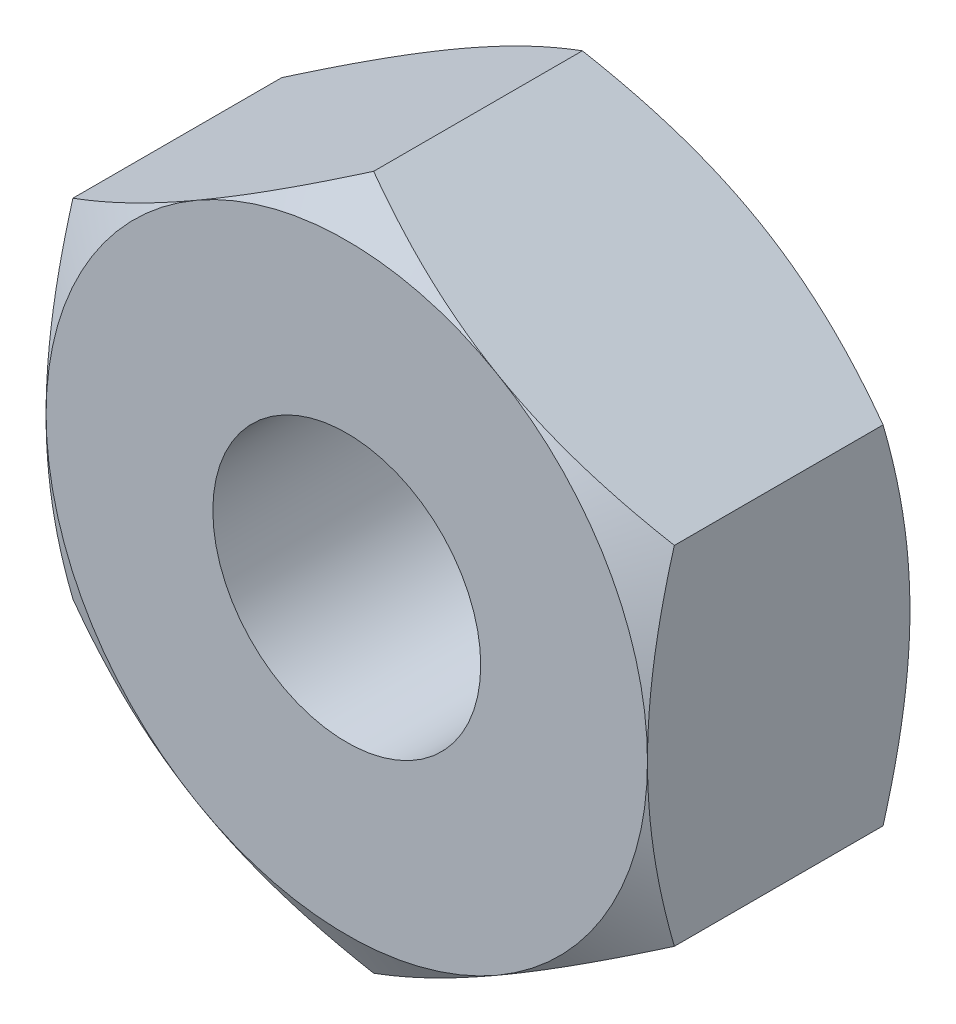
ISO-10303-21;
HEADER;
FILE_DESCRIPTION(('STEP AP214'),'2;1');
FILE_NAME('part.step','',(''),(''),'','','');
FILE_SCHEMA(('AUTOMOTIVE_DESIGN { 1 0 10303 214 1 1 1 1 }'));
ENDSEC;
DATA;
#1=APPLICATION_CONTEXT('core data for automotive mechanical design processes');
#2=APPLICATION_PROTOCOL_DEFINITION('international standard','automotive_design',2000,#1);
#3=PRODUCT_CONTEXT('',#1,'mechanical');
#4=PRODUCT('Part','Part','',(#3));
#5=PRODUCT_RELATED_PRODUCT_CATEGORY('part','',(#4));
#6=PRODUCT_DEFINITION_FORMATION('','',#4);
#7=PRODUCT_DEFINITION_CONTEXT('part definition',#1,'design');
#8=PRODUCT_DEFINITION('design','',#6,#7);
#9=PRODUCT_DEFINITION_SHAPE('','',#8);
#10=(LENGTH_UNIT() NAMED_UNIT(*) SI_UNIT(.MILLI.,.METRE.));
#11=(NAMED_UNIT(*) PLANE_ANGLE_UNIT() SI_UNIT($,.RADIAN.));
#12=(NAMED_UNIT(*) SI_UNIT($,.STERADIAN.) SOLID_ANGLE_UNIT());
#13=UNCERTAINTY_MEASURE_WITH_UNIT(LENGTH_MEASURE(1.E-05),#10,'distance_accuracy_value','');
#14=(GEOMETRIC_REPRESENTATION_CONTEXT(3) GLOBAL_UNCERTAINTY_ASSIGNED_CONTEXT((#13)) GLOBAL_UNIT_ASSIGNED_CONTEXT((#10,
#11,#12)) REPRESENTATION_CONTEXT('',''));
#15=CARTESIAN_POINT('',(0.,0.,0.));
#16=DIRECTION('',(0.,0.,1.));
#17=DIRECTION('',(1.,0.,0.));
#18=AXIS2_PLACEMENT_3D('',#15,#16,#17);
#19=CARTESIAN_POINT('',(-2.75,4.76313972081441,0.));
#20=DIRECTION('',(0.,0.,-1.));
#21=DIRECTION('',(-1.,0.,0.));
#22=AXIS2_PLACEMENT_3D('',#19,#20,#21);
#23=PLANE('',#22);
#24=CARTESIAN_POINT('',(0.,0.,0.));
#25=DIRECTION('',(0.,0.,1.));
#26=DIRECTION('',(1.,0.,0.));
#27=AXIS2_PLACEMENT_3D('',#24,#25,#26);
#28=CIRCLE('',#27,1.225);
#29=CARTESIAN_POINT('',(1.225,0.,0.));
#30=VERTEX_POINT('',#29);
#31=EDGE_CURVE('E315',#30,#30,#28,.T.);
#32=ORIENTED_EDGE('',*,*,#31,.F.);
#33=EDGE_LOOP('',(#32));
#34=FACE_BOUND('',#33,.T.);
#35=CARTESIAN_POINT('',(0.,0.,0.));
#36=DIRECTION('',(0.,0.,-1.));
#37=DIRECTION('',(-1.,0.,0.));
#38=AXIS2_PLACEMENT_3D('',#35,#36,#37);
#39=CIRCLE('',#38,2.75);
#40=CARTESIAN_POINT('',(-2.75,0.,0.));
#41=VERTEX_POINT('',#40);
#42=CARTESIAN_POINT('',(-1.375,2.38156986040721,0.));
#43=VERTEX_POINT('',#42);
#44=EDGE_CURVE('E323',#41,#43,#39,.T.);
#45=ORIENTED_EDGE('',*,*,#44,.F.);
#46=CARTESIAN_POINT('',(0.,0.,0.));
#47=DIRECTION('',(0.,0.,-1.));
#48=DIRECTION('',(-1.,0.,0.));
#49=AXIS2_PLACEMENT_3D('',#46,#47,#48);
#50=CIRCLE('',#49,2.75);
#51=CARTESIAN_POINT('',(-1.375,-2.38156986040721,0.));
#52=VERTEX_POINT('',#51);
#53=EDGE_CURVE('E143',#41,#52,#50,.F.);
#54=ORIENTED_EDGE('',*,*,#53,.T.);
#55=CARTESIAN_POINT('',(1.375,-2.38156986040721,0.));
#56=VERTEX_POINT('',#55);
#57=EDGE_CURVE('E245',#52,#56,#50,.F.);
#58=ORIENTED_EDGE('',*,*,#57,.T.);
#59=CARTESIAN_POINT('',(2.75,0.,0.));
#60=VERTEX_POINT('',#59);
#61=EDGE_CURVE('E146',#56,#60,#50,.F.);
#62=ORIENTED_EDGE('',*,*,#61,.T.);
#63=CARTESIAN_POINT('',(1.375,2.38156986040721,0.));
#64=VERTEX_POINT('',#63);
#65=EDGE_CURVE('E121',#60,#64,#50,.F.);
#66=ORIENTED_EDGE('',*,*,#65,.T.);
#67=EDGE_CURVE('E134',#64,#43,#50,.F.);
#68=ORIENTED_EDGE('',*,*,#67,.T.);
#69=EDGE_LOOP('',(#45,#54,#58,#62,#66,#68));
#70=FACE_BOUND('',#69,.T.);
#71=ADVANCED_FACE('F26',(#34,#70),#23,.F.);
#72=CARTESIAN_POINT('',(0.,0.,0.));
#73=DIRECTION('',(0.,0.,-1.));
#74=DIRECTION('',(-1.,0.,0.));
#75=AXIS2_PLACEMENT_3D('',#72,#73,#74);
#76=CONICAL_SURFACE('',#75,2.75,1.0471975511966);
#77=CARTESIAN_POINT('',(-2.75,-4.34466851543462,-1.38093653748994));
#78=CARTESIAN_POINT('',(-2.75,-4.22386779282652,-1.32202064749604));
#79=CARTESIAN_POINT('',(-2.75,-4.10279820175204,-1.26364700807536));
#80=CARTESIAN_POINT('',(-2.75,-3.85997859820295,-1.14828767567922));
#81=CARTESIAN_POINT('',(-2.75,-3.73822848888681,-1.09130218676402));
#82=CARTESIAN_POINT('',(-2.75,-3.49331526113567,-0.978752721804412));
#83=CARTESIAN_POINT('',(-2.75,-3.37014810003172,-0.923197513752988));
#84=CARTESIAN_POINT('',(-2.75,-3.1228617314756,-0.814256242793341));
#85=CARTESIAN_POINT('',(-2.75,-2.99874256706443,-0.760870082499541));
#86=CARTESIAN_POINT('',(-2.75,-2.74504756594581,-0.655040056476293));
#87=CARTESIAN_POINT('',(-2.75,-2.61543135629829,-0.602692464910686));
#88=CARTESIAN_POINT('',(-2.75,-2.35471222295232,-0.501769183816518));
#89=CARTESIAN_POINT('',(-2.75,-2.22360913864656,-0.453193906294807));
#90=CARTESIAN_POINT('',(-2.75,-1.95992838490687,-0.36103232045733));
#91=CARTESIAN_POINT('',(-2.75,-1.82735405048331,-0.317436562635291));
#92=CARTESIAN_POINT('',(-2.75,-1.56030503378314,-0.236579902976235));
#93=CARTESIAN_POINT('',(-2.75,-1.42583093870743,-0.199317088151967));
#94=CARTESIAN_POINT('',(-2.75,-1.1556720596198,-0.133064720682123));
#95=CARTESIAN_POINT('',(-2.75,-1.01999923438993,-0.104027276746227));
#96=CARTESIAN_POINT('',(-2.75,-0.746885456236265,-0.0558064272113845));
#97=CARTESIAN_POINT('',(-2.75,-0.609444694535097,-0.036621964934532));
#98=CARTESIAN_POINT('',(-2.75,-0.335308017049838,-0.00988438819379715));
#99=CARTESIAN_POINT('',(-2.75,-0.198627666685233,-0.00217562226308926));
#100=CARTESIAN_POINT('',(-2.75,0.0749013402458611,0.00137225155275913));
#101=CARTESIAN_POINT('',(-2.75,0.211749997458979,-0.00278868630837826));
#102=CARTESIAN_POINT('',(-2.75,0.441773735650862,-0.0194575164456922));
#103=CARTESIAN_POINT('',(-2.75,0.535183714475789,-0.0289378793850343));
#104=CARTESIAN_POINT('',(-2.75,0.721369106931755,-0.0528801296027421));
#105=CARTESIAN_POINT('',(-2.75,0.814144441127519,-0.067342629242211));
#106=CARTESIAN_POINT('',(-2.75,1.09135512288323,-0.117450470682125));
#107=CARTESIAN_POINT('',(-2.75,1.27458276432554,-0.1598085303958));
#108=CARTESIAN_POINT('',(-2.75,1.64148663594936,-0.258901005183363));
#109=CARTESIAN_POINT('',(-2.75,1.82507634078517,-0.315943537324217));
#110=CARTESIAN_POINT('',(-2.75,2.09789706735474,-0.408810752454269));
#111=CARTESIAN_POINT('',(-2.75,2.18840332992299,-0.440981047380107));
#112=CARTESIAN_POINT('',(-2.75,2.36865794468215,-0.507377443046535));
#113=CARTESIAN_POINT('',(-2.75,2.45840631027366,-0.541603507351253));
#114=CARTESIAN_POINT('',(-2.75,2.68603060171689,-0.630917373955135));
#115=CARTESIAN_POINT('',(-2.75,2.82343831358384,-0.687195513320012));
#116=CARTESIAN_POINT('',(-2.75,3.09693392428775,-0.802882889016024));
#117=CARTESIAN_POINT('',(-2.75,3.23302170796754,-0.862292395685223));
#118=CARTESIAN_POINT('',(-2.75,3.50414954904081,-0.983551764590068));
#119=CARTESIAN_POINT('',(-2.75,3.63918929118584,-1.04540232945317));
#120=CARTESIAN_POINT('',(-2.75,3.90838030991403,-1.17101091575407));
#121=CARTESIAN_POINT('',(-2.75,4.0425315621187,-1.23476898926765));
#122=CARTESIAN_POINT('',(-2.75,4.44426655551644,-1.42847314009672));
#123=CARTESIAN_POINT('',(-2.75,4.71075917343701,-1.56067980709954));
#124=CARTESIAN_POINT('',(-2.75,5.2417025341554,-1.82899066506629));
#125=CARTESIAN_POINT('',(-2.75,5.50615362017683,-1.96509418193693));
#126=CARTESIAN_POINT('',(-2.75,6.00831212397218,-2.22681256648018));
#127=CARTESIAN_POINT('',(-2.75,6.24614899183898,-2.35217951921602));
#128=CARTESIAN_POINT('',(-2.75,6.72096497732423,-2.60455330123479));
#129=CARTESIAN_POINT('',(-2.75,6.95794405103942,-2.73156021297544));
#130=CARTESIAN_POINT('',(-2.75,7.43050912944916,-2.986411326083));
#131=CARTESIAN_POINT('',(-2.75,7.66609717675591,-3.11425174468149));
#132=CARTESIAN_POINT('',(-2.75,8.13673290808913,-3.37088488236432));
#133=CARTESIAN_POINT('',(-2.75,8.37178062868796,-3.4996775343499));
#134=CARTESIAN_POINT('',(-2.75,8.60663455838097,-3.62882004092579));
#135=B_SPLINE_CURVE_WITH_KNOTS('',3,(#77,#78,#79,#80,#81,#82,#83,#84,#85,#86,#87,#88,#89,#90,
#91,#92,#93,#94,#95,#96,#97,#98,#99,#100,#101,#102,#103,#104,#105,#106,#107,#108,#109,#110,#111,
#112,#113,#114,#115,#116,#117,#118,#119,#120,#121,#122,#123,#124,#125,#126,#127,#128,#129,#130,
#131,#132,#133,#134),.UNSPECIFIED.,.F.,.F.,(4,2,2,2,2,2,2,2,2,2,2,2,2,2,2,2,2,2,2,2,2,2,2,2,2,2,
2,2,4),(0.,0.403210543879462,0.806480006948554,1.21181340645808,1.61712858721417,
2.03644659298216,2.45581033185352,2.87436454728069,3.29279210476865,3.70873084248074,
4.12462496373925,4.53482497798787,4.94502657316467,5.22656209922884,5.5081322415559,
6.07154931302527,6.64791900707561,6.93606074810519,7.22419738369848,7.66960136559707,
8.11504386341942,8.56061552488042,9.00619936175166,9.89859387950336,10.7908349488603,
11.5973926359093,12.4039910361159,13.2081055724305,14.0121639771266),.UNSPECIFIED.);
#136=CARTESIAN_POINT('',(-2.75,1.58771324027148,-0.245620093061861));
#137=VERTEX_POINT('',#136);
#138=EDGE_CURVE('E151',#137,#41,#135,.F.);
#139=ORIENTED_EDGE('',*,*,#138,.T.);
#140=ORIENTED_EDGE('',*,*,#44,.T.);
#141=CARTESIAN_POINT('',(0.0002,3.17554195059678,-0.245686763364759));
#142=CARTESIAN_POINT('',(-0.120649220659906,3.10576962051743,-0.205387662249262));
#143=CARTESIAN_POINT('',(-0.242541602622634,3.03539502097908,-0.168736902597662));
#144=CARTESIAN_POINT('',(-0.488437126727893,2.89342717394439,-0.104762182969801));
#145=CARTESIAN_POINT('',(-0.612444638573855,2.82183140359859,-0.077460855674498));
#146=CARTESIAN_POINT('',(-0.858922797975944,2.67952717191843,-0.0349617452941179));
#147=CARTESIAN_POINT('',(-0.981355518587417,2.60884060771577,-0.019481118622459));
#148=CARTESIAN_POINT('',(-1.22679714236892,2.46713482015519,-0.000999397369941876));
#149=CARTESIAN_POINT('',(-1.34980515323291,2.39611611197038,0.00201700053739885));
#150=CARTESIAN_POINT('',(-1.57965878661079,2.26341005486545,-0.0042531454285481));
#151=CARTESIAN_POINT('',(-1.68653879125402,2.20170285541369,-0.0120001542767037));
#152=CARTESIAN_POINT('',(-1.89960246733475,2.07869048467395,-0.0365551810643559));
#153=CARTESIAN_POINT('',(-2.00578540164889,2.01738573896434,-0.0533715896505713));
#154=CARTESIAN_POINT('',(-2.21928848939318,1.89411967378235,-0.0954119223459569));
#155=CARTESIAN_POINT('',(-2.32658161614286,1.83217395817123,-0.120814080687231));
#156=CARTESIAN_POINT('',(-2.53956747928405,1.70920651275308,-0.178467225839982));
#157=CARTESIAN_POINT('',(-2.64526294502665,1.64818320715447,-0.210704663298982));
#158=CARTESIAN_POINT('',(-2.7502,1.58759777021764,-0.245686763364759));
#159=B_SPLINE_CURVE_WITH_KNOTS('',3,(#141,#142,#143,#144,#145,#146,#147,#148,#149,#150,#151,
#152,#153,#154,#155,#156,#157,#158),.UNSPECIFIED.,.F.,.F.,(4,2,2,2,2,2,2,2,4),(0.,
0.435912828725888,0.872873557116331,1.29901931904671,1.72464171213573,2.09526089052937,
2.46622354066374,2.84541551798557,3.22386274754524),.UNSPECIFIED.);
#160=EDGE_CURVE('E183',#43,#137,#159,.T.);
#161=ORIENTED_EDGE('',*,*,#160,.T.);
#162=EDGE_LOOP('',(#139,#140,#161));
#163=FACE_BOUND('',#162,.T.);
#164=ADVANCED_FACE('F170',(#163),#76,.T.);
#165=CARTESIAN_POINT('',(2.7502,1.58759777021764,-0.245686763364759));
#166=CARTESIAN_POINT('',(2.62935077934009,1.65737010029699,-0.205387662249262));
#167=CARTESIAN_POINT('',(2.50745839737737,1.72774469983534,-0.168736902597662));
#168=CARTESIAN_POINT('',(2.26156287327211,1.86971254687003,-0.104762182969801));
#169=CARTESIAN_POINT('',(2.13755536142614,1.94130831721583,-0.0774608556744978));
#170=CARTESIAN_POINT('',(1.89107720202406,2.08361254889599,-0.0349617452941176));
#171=CARTESIAN_POINT('',(1.76864448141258,2.15429911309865,-0.0194811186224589));
#172=CARTESIAN_POINT('',(1.52320285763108,2.29600490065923,-0.000999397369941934));
#173=CARTESIAN_POINT('',(1.40019484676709,2.36702360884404,0.00201700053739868));
#174=CARTESIAN_POINT('',(1.17034121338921,2.49972966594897,-0.00425314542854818));
#175=CARTESIAN_POINT('',(1.06346120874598,2.56143686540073,-0.0120001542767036));
#176=CARTESIAN_POINT('',(0.85039753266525,2.68444923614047,-0.0365551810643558));
#177=CARTESIAN_POINT('',(0.744214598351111,2.74575398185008,-0.0533715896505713));
#178=CARTESIAN_POINT('',(0.530711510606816,2.86902004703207,-0.0954119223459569));
#179=CARTESIAN_POINT('',(0.423418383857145,2.93096576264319,-0.120814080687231));
#180=CARTESIAN_POINT('',(0.210432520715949,3.05393320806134,-0.178467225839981));
#181=CARTESIAN_POINT('',(0.104737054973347,3.11495651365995,-0.210704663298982));
#182=CARTESIAN_POINT('',(-0.000199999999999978,3.17554195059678,-0.245686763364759));
#183=B_SPLINE_CURVE_WITH_KNOTS('',3,(#165,#166,#167,#168,#169,#170,#171,#172,#173,#174,#175,
#176,#177,#178,#179,#180,#181,#182),.UNSPECIFIED.,.F.,.F.,(4,2,2,2,2,2,2,2,4),(0.,
0.435912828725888,0.872873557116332,1.29901931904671,1.72464171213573,2.09526089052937,
2.46622354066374,2.84541551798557,3.22386274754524),.UNSPECIFIED.);
#184=CARTESIAN_POINT('',(0.,3.17542648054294,-0.245620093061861));
#185=VERTEX_POINT('',#184);
#186=EDGE_CURVE('E130',#64,#185,#183,.T.);
#187=ORIENTED_EDGE('',*,*,#186,.T.);
#188=EDGE_CURVE('E137',#185,#43,#159,.T.);
#189=ORIENTED_EDGE('',*,*,#188,.T.);
#190=ORIENTED_EDGE('',*,*,#67,.F.);
#191=EDGE_LOOP('',(#187,#189,#190));
#192=FACE_BOUND('',#191,.T.);
#193=ADVANCED_FACE('F135',(#192),#76,.T.);
#194=CARTESIAN_POINT('',(2.75,-4.34466851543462,-1.38093653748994));
#195=CARTESIAN_POINT('',(2.75,-4.22386779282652,-1.32202064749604));
#196=CARTESIAN_POINT('',(2.75,-4.10279820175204,-1.26364700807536));
#197=CARTESIAN_POINT('',(2.75,-3.85997859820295,-1.14828767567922));
#198=CARTESIAN_POINT('',(2.75,-3.73822848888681,-1.09130218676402));
#199=CARTESIAN_POINT('',(2.75,-3.49331526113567,-0.978752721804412));
#200=CARTESIAN_POINT('',(2.75,-3.37014810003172,-0.923197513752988));
#201=CARTESIAN_POINT('',(2.75,-3.1228617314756,-0.814256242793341));
#202=CARTESIAN_POINT('',(2.75,-2.99874256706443,-0.760870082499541));
#203=CARTESIAN_POINT('',(2.75,-2.74504756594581,-0.655040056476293));
#204=CARTESIAN_POINT('',(2.75,-2.61543135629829,-0.602692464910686));
#205=CARTESIAN_POINT('',(2.75,-2.35471222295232,-0.501769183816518));
#206=CARTESIAN_POINT('',(2.75,-2.22360913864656,-0.453193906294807));
#207=CARTESIAN_POINT('',(2.75,-1.95992838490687,-0.36103232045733));
#208=CARTESIAN_POINT('',(2.75,-1.82735405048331,-0.317436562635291));
#209=CARTESIAN_POINT('',(2.75,-1.56030503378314,-0.236579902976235));
#210=CARTESIAN_POINT('',(2.75,-1.42583093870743,-0.199317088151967));
#211=CARTESIAN_POINT('',(2.75,-1.1556720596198,-0.133064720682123));
#212=CARTESIAN_POINT('',(2.75,-1.01999923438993,-0.104027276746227));
#213=CARTESIAN_POINT('',(2.75,-0.746885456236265,-0.0558064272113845));
#214=CARTESIAN_POINT('',(2.75,-0.609444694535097,-0.036621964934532));
#215=CARTESIAN_POINT('',(2.75,-0.335308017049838,-0.00988438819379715));
#216=CARTESIAN_POINT('',(2.75,-0.198627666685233,-0.00217562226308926));
#217=CARTESIAN_POINT('',(2.75,0.0749013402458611,0.00137225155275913));
#218=CARTESIAN_POINT('',(2.75,0.211749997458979,-0.00278868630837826));
#219=CARTESIAN_POINT('',(2.75,0.441773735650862,-0.0194575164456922));
#220=CARTESIAN_POINT('',(2.75,0.535183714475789,-0.0289378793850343));
#221=CARTESIAN_POINT('',(2.75,0.721369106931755,-0.0528801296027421));
#222=CARTESIAN_POINT('',(2.75,0.814144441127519,-0.067342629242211));
#223=CARTESIAN_POINT('',(2.75,1.09135512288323,-0.117450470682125));
#224=CARTESIAN_POINT('',(2.75,1.27458276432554,-0.1598085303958));
#225=CARTESIAN_POINT('',(2.75,1.64148663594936,-0.258901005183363));
#226=CARTESIAN_POINT('',(2.75,1.82507634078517,-0.315943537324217));
#227=CARTESIAN_POINT('',(2.75,2.09789706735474,-0.408810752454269));
#228=CARTESIAN_POINT('',(2.75,2.18840332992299,-0.440981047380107));
#229=CARTESIAN_POINT('',(2.75,2.36865794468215,-0.507377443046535));
#230=CARTESIAN_POINT('',(2.75,2.45840631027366,-0.541603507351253));
#231=CARTESIAN_POINT('',(2.75,2.68603060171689,-0.630917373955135));
#232=CARTESIAN_POINT('',(2.75,2.82343831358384,-0.687195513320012));
#233=CARTESIAN_POINT('',(2.75,3.09693392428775,-0.802882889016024));
#234=CARTESIAN_POINT('',(2.75,3.23302170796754,-0.862292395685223));
#235=CARTESIAN_POINT('',(2.75,3.50414954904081,-0.983551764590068));
#236=CARTESIAN_POINT('',(2.75,3.63918929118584,-1.04540232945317));
#237=CARTESIAN_POINT('',(2.75,3.90838030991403,-1.17101091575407));
#238=CARTESIAN_POINT('',(2.75,4.0425315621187,-1.23476898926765));
#239=CARTESIAN_POINT('',(2.75,4.44426655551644,-1.42847314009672));
#240=CARTESIAN_POINT('',(2.75,4.71075917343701,-1.56067980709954));
#241=CARTESIAN_POINT('',(2.75,5.2417025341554,-1.82899066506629));
#242=CARTESIAN_POINT('',(2.75,5.50615362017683,-1.96509418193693));
#243=CARTESIAN_POINT('',(2.75,6.00831212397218,-2.22681256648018));
#244=CARTESIAN_POINT('',(2.75,6.24614899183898,-2.35217951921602));
#245=CARTESIAN_POINT('',(2.75,6.72096497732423,-2.60455330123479));
#246=CARTESIAN_POINT('',(2.75,6.95794405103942,-2.73156021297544));
#247=CARTESIAN_POINT('',(2.75,7.43050912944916,-2.986411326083));
#248=CARTESIAN_POINT('',(2.75,7.66609717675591,-3.11425174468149));
#249=CARTESIAN_POINT('',(2.75,8.13673290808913,-3.37088488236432));
#250=CARTESIAN_POINT('',(2.75,8.37178062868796,-3.4996775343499));
#251=CARTESIAN_POINT('',(2.75,8.60663455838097,-3.62882004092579));
#252=B_SPLINE_CURVE_WITH_KNOTS('',3,(#194,#195,#196,#197,#198,#199,#200,#201,#202,#203,#204,
#205,#206,#207,#208,#209,#210,#211,#212,#213,#214,#215,#216,#217,#218,#219,#220,#221,#222,#223,
#224,#225,#226,#227,#228,#229,#230,#231,#232,#233,#234,#235,#236,#237,#238,#239,#240,#241,#242,
#243,#244,#245,#246,#247,#248,#249,#250,#251),.UNSPECIFIED.,.F.,.F.,(4,2,2,2,2,2,2,2,2,2,2,2,2,
2,2,2,2,2,2,2,2,2,2,2,2,2,2,2,4),(0.,0.403210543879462,0.806480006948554,1.21181340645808,
1.61712858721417,2.03644659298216,2.45581033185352,2.87436454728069,3.29279210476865,
3.70873084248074,4.12462496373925,4.53482497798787,4.94502657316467,5.22656209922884,
5.5081322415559,6.07154931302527,6.64791900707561,6.93606074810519,7.22419738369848,
7.66960136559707,8.11504386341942,8.56061552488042,9.00619936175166,9.89859387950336,
10.7908349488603,11.5973926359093,12.4039910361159,13.2081055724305,14.0121639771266),.UNSPECIFIED.);
#253=CARTESIAN_POINT('',(2.75,1.58771324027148,-0.245620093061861));
#254=VERTEX_POINT('',#253);
#255=EDGE_CURVE('E124',#60,#254,#252,.T.);
#256=ORIENTED_EDGE('',*,*,#255,.T.);
#257=EDGE_CURVE('E117',#254,#64,#183,.T.);
#258=ORIENTED_EDGE('',*,*,#257,.T.);
#259=ORIENTED_EDGE('',*,*,#65,.F.);
#260=EDGE_LOOP('',(#256,#258,#259));
#261=FACE_BOUND('',#260,.T.);
#262=ADVANCED_FACE('F119',(#261),#76,.T.);
#263=CARTESIAN_POINT('',(-0.0002,-3.17554195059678,-0.245686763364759));
#264=CARTESIAN_POINT('',(0.120649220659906,-3.10576962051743,-0.205387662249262));
#265=CARTESIAN_POINT('',(0.242541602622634,-3.03539502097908,-0.168736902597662));
#266=CARTESIAN_POINT('',(0.488437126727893,-2.89342717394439,-0.104762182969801));
#267=CARTESIAN_POINT('',(0.612444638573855,-2.82183140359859,-0.077460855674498));
#268=CARTESIAN_POINT('',(0.858922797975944,-2.67952717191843,-0.0349617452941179));
#269=CARTESIAN_POINT('',(0.981355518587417,-2.60884060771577,-0.019481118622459));
#270=CARTESIAN_POINT('',(1.22679714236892,-2.46713482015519,-0.000999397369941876));
#271=CARTESIAN_POINT('',(1.34980515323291,-2.39611611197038,0.00201700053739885));
#272=CARTESIAN_POINT('',(1.57965878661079,-2.26341005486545,-0.0042531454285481));
#273=CARTESIAN_POINT('',(1.68653879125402,-2.20170285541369,-0.0120001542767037));
#274=CARTESIAN_POINT('',(1.89960246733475,-2.07869048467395,-0.0365551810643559));
#275=CARTESIAN_POINT('',(2.00578540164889,-2.01738573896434,-0.0533715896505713));
#276=CARTESIAN_POINT('',(2.21928848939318,-1.89411967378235,-0.0954119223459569));
#277=CARTESIAN_POINT('',(2.32658161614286,-1.83217395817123,-0.120814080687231));
#278=CARTESIAN_POINT('',(2.53956747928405,-1.70920651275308,-0.178467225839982));
#279=CARTESIAN_POINT('',(2.64526294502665,-1.64818320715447,-0.210704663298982));
#280=CARTESIAN_POINT('',(2.7502,-1.58759777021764,-0.245686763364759));
#281=B_SPLINE_CURVE_WITH_KNOTS('',3,(#263,#264,#265,#266,#267,#268,#269,#270,#271,#272,#273,
#274,#275,#276,#277,#278,#279,#280),.UNSPECIFIED.,.F.,.F.,(4,2,2,2,2,2,2,2,4),(0.,
0.435912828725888,0.872873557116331,1.29901931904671,1.72464171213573,2.09526089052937,
2.46622354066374,2.84541551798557,3.22386274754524),.UNSPECIFIED.);
#282=CARTESIAN_POINT('',(2.75,-1.58771324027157,-0.245620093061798));
#283=VERTEX_POINT('',#282);
#284=EDGE_CURVE('E197',#56,#283,#281,.T.);
#285=ORIENTED_EDGE('',*,*,#284,.T.);
#286=EDGE_CURVE('E196',#283,#60,#252,.T.);
#287=ORIENTED_EDGE('',*,*,#286,.T.);
#288=ORIENTED_EDGE('',*,*,#61,.F.);
#289=EDGE_LOOP('',(#285,#287,#288));
#290=FACE_BOUND('',#289,.T.);
#291=ADVANCED_FACE('F380',(#290),#76,.T.);
#292=CARTESIAN_POINT('',(0.,-3.17542648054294,-0.245620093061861));
#293=VERTEX_POINT('',#292);
#294=EDGE_CURVE('E255',#293,#56,#281,.T.);
#295=ORIENTED_EDGE('',*,*,#294,.T.);
#296=ORIENTED_EDGE('',*,*,#57,.F.);
#297=CARTESIAN_POINT('',(-2.7502,-1.58759777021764,-0.245686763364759));
#298=CARTESIAN_POINT('',(-2.62935077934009,-1.65737010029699,-0.205387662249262));
#299=CARTESIAN_POINT('',(-2.50745839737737,-1.72774469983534,-0.168736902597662));
#300=CARTESIAN_POINT('',(-2.26156287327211,-1.86971254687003,-0.104762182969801));
#301=CARTESIAN_POINT('',(-2.13755536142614,-1.94130831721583,-0.0774608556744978));
#302=CARTESIAN_POINT('',(-1.89107720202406,-2.08361254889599,-0.0349617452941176));
#303=CARTESIAN_POINT('',(-1.76864448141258,-2.15429911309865,-0.0194811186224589));
#304=CARTESIAN_POINT('',(-1.52320285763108,-2.29600490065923,-0.000999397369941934));
#305=CARTESIAN_POINT('',(-1.40019484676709,-2.36702360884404,0.00201700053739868));
#306=CARTESIAN_POINT('',(-1.17034121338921,-2.49972966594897,-0.00425314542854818));
#307=CARTESIAN_POINT('',(-1.06346120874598,-2.56143686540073,-0.0120001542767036));
#308=CARTESIAN_POINT('',(-0.85039753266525,-2.68444923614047,-0.0365551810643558));
#309=CARTESIAN_POINT('',(-0.744214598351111,-2.74575398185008,-0.0533715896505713));
#310=CARTESIAN_POINT('',(-0.530711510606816,-2.86902004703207,-0.0954119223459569));
#311=CARTESIAN_POINT('',(-0.423418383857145,-2.93096576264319,-0.120814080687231));
#312=CARTESIAN_POINT('',(-0.210432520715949,-3.05393320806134,-0.178467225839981));
#313=CARTESIAN_POINT('',(-0.104737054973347,-3.11495651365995,-0.210704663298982));
#314=CARTESIAN_POINT('',(0.000199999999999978,-3.17554195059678,-0.245686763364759));
#315=B_SPLINE_CURVE_WITH_KNOTS('',3,(#297,#298,#299,#300,#301,#302,#303,#304,#305,#306,#307,
#308,#309,#310,#311,#312,#313,#314),.UNSPECIFIED.,.F.,.F.,(4,2,2,2,2,2,2,2,4),(0.,
0.435912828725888,0.872873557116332,1.29901931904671,1.72464171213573,2.09526089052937,
2.46622354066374,2.84541551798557,3.22386274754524),.UNSPECIFIED.);
#316=EDGE_CURVE('E259',#52,#293,#315,.T.);
#317=ORIENTED_EDGE('',*,*,#316,.T.);
#318=EDGE_LOOP('',(#295,#296,#317));
#319=FACE_BOUND('',#318,.T.);
#320=ADVANCED_FACE('F176',(#319),#76,.T.);
#321=CARTESIAN_POINT('',(-2.75,-1.58771324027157,-0.245620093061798));
#322=VERTEX_POINT('',#321);
#323=EDGE_CURVE('E164',#322,#52,#315,.T.);
#324=ORIENTED_EDGE('',*,*,#323,.T.);
#325=ORIENTED_EDGE('',*,*,#53,.F.);
#326=EDGE_CURVE('E129',#41,#322,#135,.F.);
#327=ORIENTED_EDGE('',*,*,#326,.T.);
#328=EDGE_LOOP('',(#324,#325,#327));
#329=FACE_BOUND('',#328,.T.);
#330=ADVANCED_FACE('F264',(#329),#76,.T.);
#331=CARTESIAN_POINT('',(2.75,1.58771324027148,-2.4));
#332=DIRECTION('',(0.5,0.866025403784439,0.));
#333=DIRECTION('',(-0.866025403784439,0.5,0.));
#334=AXIS2_PLACEMENT_3D('',#331,#332,#333);
#335=PLANE('',#334);
#336=CARTESIAN_POINT('',(-0.0002,3.17554195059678,-2.15431323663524));
#337=CARTESIAN_POINT('',(0.120649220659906,3.10576962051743,-2.19461233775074));
#338=CARTESIAN_POINT('',(0.242541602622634,3.03539502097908,-2.23126309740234));
#339=CARTESIAN_POINT('',(0.488437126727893,2.89342717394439,-2.2952378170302));
#340=CARTESIAN_POINT('',(0.612444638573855,2.82183140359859,-2.3225391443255));
#341=CARTESIAN_POINT('',(0.858922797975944,2.67952717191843,-2.36503825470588));
#342=CARTESIAN_POINT('',(0.981355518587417,2.60884060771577,-2.38051888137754));
#343=CARTESIAN_POINT('',(1.22679714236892,2.46713482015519,-2.39900060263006));
#344=CARTESIAN_POINT('',(1.34980515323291,2.39611611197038,-2.4020170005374));
#345=CARTESIAN_POINT('',(1.57965878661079,2.26341005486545,-2.39574685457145));
#346=CARTESIAN_POINT('',(1.68653879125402,2.20170285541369,-2.3879998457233));
#347=CARTESIAN_POINT('',(1.89960246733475,2.07869048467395,-2.36344481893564));
#348=CARTESIAN_POINT('',(2.00578540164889,2.01738573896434,-2.34662841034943));
#349=CARTESIAN_POINT('',(2.21928848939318,1.89411967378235,-2.30458807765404));
#350=CARTESIAN_POINT('',(2.32658161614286,1.83217395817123,-2.27918591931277));
#351=CARTESIAN_POINT('',(2.53956747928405,1.70920651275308,-2.22153277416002));
#352=CARTESIAN_POINT('',(2.64526294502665,1.64818320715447,-2.18929533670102));
#353=CARTESIAN_POINT('',(2.7502,1.58759777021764,-2.15431323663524));
#354=B_SPLINE_CURVE_WITH_KNOTS('',3,(#336,#337,#338,#339,#340,#341,#342,#343,#344,#345,#346,
#347,#348,#349,#350,#351,#352,#353),.UNSPECIFIED.,.F.,.F.,(4,2,2,2,2,2,2,2,4),(0.,
0.435912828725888,0.872873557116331,1.29901931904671,1.72464171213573,2.09526089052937,
2.46622354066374,2.84541551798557,3.22386274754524),.UNSPECIFIED.);
#355=CARTESIAN_POINT('',(0.,3.17542648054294,-2.15437990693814));
#356=VERTEX_POINT('',#355);
#357=CARTESIAN_POINT('',(1.375,2.38156986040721,-2.4));
#358=VERTEX_POINT('',#357);
#359=EDGE_CURVE('E230',#356,#358,#354,.T.);
#360=ORIENTED_EDGE('',*,*,#359,.F.);
#361=DIRECTION('',(0.,0.,1.));
#362=VECTOR('',#361,1.);
#363=CARTESIAN_POINT('',(0.,3.17542648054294,-2.4));
#364=LINE('',#363,#362);
#365=EDGE_CURVE('E150',#356,#185,#364,.T.);
#366=ORIENTED_EDGE('',*,*,#365,.T.);
#367=ORIENTED_EDGE('',*,*,#186,.F.);
#368=ORIENTED_EDGE('',*,*,#257,.F.);
#369=DIRECTION('',(0.,0.,1.));
#370=VECTOR('',#369,1.);
#371=CARTESIAN_POINT('',(2.75,1.58771324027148,-2.4));
#372=LINE('',#371,#370);
#373=CARTESIAN_POINT('',(2.75,1.58771324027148,-2.15437990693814));
#374=VERTEX_POINT('',#373);
#375=EDGE_CURVE('E142',#374,#254,#372,.T.);
#376=ORIENTED_EDGE('',*,*,#375,.F.);
#377=EDGE_CURVE('E225',#358,#374,#354,.T.);
#378=ORIENTED_EDGE('',*,*,#377,.F.);
#379=EDGE_LOOP('',(#360,#366,#367,#368,#376,#378));
#380=FACE_BOUND('',#379,.T.);
#381=ADVANCED_FACE('F28',(#380),#335,.T.);
#382=CARTESIAN_POINT('',(2.75,-1.58771324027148,-2.4));
#383=DIRECTION('',(1.,0.,0.));
#384=DIRECTION('',(0.,0.,-1.));
#385=AXIS2_PLACEMENT_3D('',#382,#383,#384);
#386=PLANE('',#385);
#387=CARTESIAN_POINT('',(2.75,-4.34466851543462,-1.01906346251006));
#388=CARTESIAN_POINT('',(2.75,-4.22386779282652,-1.07797935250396));
#389=CARTESIAN_POINT('',(2.75,-4.10279820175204,-1.13635299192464));
#390=CARTESIAN_POINT('',(2.75,-3.85997859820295,-1.25171232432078));
#391=CARTESIAN_POINT('',(2.75,-3.73822848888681,-1.30869781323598));
#392=CARTESIAN_POINT('',(2.75,-3.49331526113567,-1.42124727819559));
#393=CARTESIAN_POINT('',(2.75,-3.37014810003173,-1.47680248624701));
#394=CARTESIAN_POINT('',(2.75,-3.1228617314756,-1.58574375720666));
#395=CARTESIAN_POINT('',(2.75,-2.99874256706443,-1.63912991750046));
#396=CARTESIAN_POINT('',(2.75,-2.74504756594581,-1.74495994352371));
#397=CARTESIAN_POINT('',(2.75,-2.61543135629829,-1.79730753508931));
#398=CARTESIAN_POINT('',(2.75,-2.35471222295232,-1.89823081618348));
#399=CARTESIAN_POINT('',(2.75,-2.22360913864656,-1.94680609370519));
#400=CARTESIAN_POINT('',(2.75,-1.95992838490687,-2.03896767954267));
#401=CARTESIAN_POINT('',(2.75,-1.82735405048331,-2.08256343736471));
#402=CARTESIAN_POINT('',(2.75,-1.56030503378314,-2.16342009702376));
#403=CARTESIAN_POINT('',(2.75,-1.42583093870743,-2.20068291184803));
#404=CARTESIAN_POINT('',(2.75,-1.1556720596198,-2.26693527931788));
#405=CARTESIAN_POINT('',(2.75,-1.01999923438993,-2.29597272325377));
#406=CARTESIAN_POINT('',(2.75,-0.746885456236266,-2.34419357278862));
#407=CARTESIAN_POINT('',(2.75,-0.609444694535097,-2.36337803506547));
#408=CARTESIAN_POINT('',(2.75,-0.335308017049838,-2.3901156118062));
#409=CARTESIAN_POINT('',(2.75,-0.198627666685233,-2.39782437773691));
#410=CARTESIAN_POINT('',(2.75,0.0749013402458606,-2.40137225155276));
#411=CARTESIAN_POINT('',(2.75,0.211749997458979,-2.39721131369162));
#412=CARTESIAN_POINT('',(2.75,0.441773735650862,-2.38054248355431));
#413=CARTESIAN_POINT('',(2.75,0.535183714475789,-2.37106212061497));
#414=CARTESIAN_POINT('',(2.75,0.721369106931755,-2.34711987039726));
#415=CARTESIAN_POINT('',(2.75,0.814144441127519,-2.33265737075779));
#416=CARTESIAN_POINT('',(2.75,1.09135512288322,-2.28254952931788));
#417=CARTESIAN_POINT('',(2.75,1.27458276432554,-2.2401914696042));
#418=CARTESIAN_POINT('',(2.75,1.64148663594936,-2.14109899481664));
#419=CARTESIAN_POINT('',(2.75,1.82507634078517,-2.08405646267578));
#420=CARTESIAN_POINT('',(2.75,2.09789706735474,-1.99118924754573));
#421=CARTESIAN_POINT('',(2.75,2.18840332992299,-1.95901895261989));
#422=CARTESIAN_POINT('',(2.75,2.36865794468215,-1.89262255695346));
#423=CARTESIAN_POINT('',(2.75,2.45840631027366,-1.85839649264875));
#424=CARTESIAN_POINT('',(2.75,2.68603060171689,-1.76908262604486));
#425=CARTESIAN_POINT('',(2.75,2.82343831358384,-1.71280448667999));
#426=CARTESIAN_POINT('',(2.75,3.09693392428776,-1.59711711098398));
#427=CARTESIAN_POINT('',(2.75,3.23302170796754,-1.53770760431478));
#428=CARTESIAN_POINT('',(2.75,3.50414954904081,-1.41644823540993));
#429=CARTESIAN_POINT('',(2.75,3.63918929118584,-1.35459767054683));
#430=CARTESIAN_POINT('',(2.75,3.90838030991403,-1.22898908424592));
#431=CARTESIAN_POINT('',(2.75,4.0425315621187,-1.16523101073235));
#432=CARTESIAN_POINT('',(2.75,4.44426655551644,-0.971526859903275));
#433=CARTESIAN_POINT('',(2.75,4.71075917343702,-0.839320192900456));
#434=CARTESIAN_POINT('',(2.75,5.2417025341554,-0.57100933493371));
#435=CARTESIAN_POINT('',(2.75,5.50615362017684,-0.43490581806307));
#436=CARTESIAN_POINT('',(2.75,6.00831212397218,-0.173187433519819));
#437=CARTESIAN_POINT('',(2.75,6.24614899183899,-0.047820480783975));
#438=CARTESIAN_POINT('',(2.75,6.72096497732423,0.204553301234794));
#439=CARTESIAN_POINT('',(2.75,6.95794405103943,0.331560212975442));
#440=CARTESIAN_POINT('',(2.75,7.43050912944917,0.586411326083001));
#441=CARTESIAN_POINT('',(2.75,7.66609717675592,0.714251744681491));
#442=CARTESIAN_POINT('',(2.75,8.13673290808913,0.97088488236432));
#443=CARTESIAN_POINT('',(2.75,8.37178062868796,1.0996775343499));
#444=CARTESIAN_POINT('',(2.75,8.60663455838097,1.22882004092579));
#445=B_SPLINE_CURVE_WITH_KNOTS('',3,(#387,#388,#389,#390,#391,#392,#393,#394,#395,#396,#397,
#398,#399,#400,#401,#402,#403,#404,#405,#406,#407,#408,#409,#410,#411,#412,#413,#414,#415,#416,
#417,#418,#419,#420,#421,#422,#423,#424,#425,#426,#427,#428,#429,#430,#431,#432,#433,#434,#435,
#436,#437,#438,#439,#440,#441,#442,#443,#444),.UNSPECIFIED.,.F.,.F.,(4,2,2,2,2,2,2,2,2,2,2,2,2,
2,2,2,2,2,2,2,2,2,2,2,2,2,2,2,4),(0.,0.403210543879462,0.806480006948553,1.21181340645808,
1.61712858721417,2.03644659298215,2.45581033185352,2.87436454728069,3.29279210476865,
3.70873084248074,4.12462496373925,4.53482497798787,4.94502657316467,5.22656209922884,
5.5081322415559,6.07154931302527,6.64791900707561,6.93606074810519,7.22419738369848,
7.66960136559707,8.11504386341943,8.56061552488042,9.00619936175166,9.89859387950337,
10.7908349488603,11.5973926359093,12.4039910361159,13.2081055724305,14.0121639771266),.UNSPECIFIED.);
#446=CARTESIAN_POINT('',(2.75,0.,-2.4));
#447=VERTEX_POINT('',#446);
#448=EDGE_CURVE('E219',#374,#447,#445,.F.);
#449=ORIENTED_EDGE('',*,*,#448,.F.);
#450=ORIENTED_EDGE('',*,*,#375,.T.);
#451=ORIENTED_EDGE('',*,*,#255,.F.);
#452=ORIENTED_EDGE('',*,*,#286,.F.);
#453=DIRECTION('',(0.,0.,1.));
#454=VECTOR('',#453,1.);
#455=CARTESIAN_POINT('',(2.75,-1.58771324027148,-2.4));
#456=LINE('',#455,#454);
#457=CARTESIAN_POINT('',(2.75,-1.58771324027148,-2.15437990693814));
#458=VERTEX_POINT('',#457);
#459=EDGE_CURVE('E232',#458,#283,#456,.T.);
#460=ORIENTED_EDGE('',*,*,#459,.F.);
#461=EDGE_CURVE('E213',#447,#458,#445,.F.);
#462=ORIENTED_EDGE('',*,*,#461,.F.);
#463=EDGE_LOOP('',(#449,#450,#451,#452,#460,#462));
#464=FACE_BOUND('',#463,.T.);
#465=ADVANCED_FACE('F203',(#464),#386,.T.);
#466=CARTESIAN_POINT('',(2.75,-1.58771324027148,-2.4));
#467=DIRECTION('',(0.5,-0.866025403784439,0.));
#468=DIRECTION('',(0.866025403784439,0.5,0.));
#469=AXIS2_PLACEMENT_3D('',#466,#467,#468);
#470=PLANE('',#469);
#471=CARTESIAN_POINT('',(2.7502,-1.58759777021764,-2.15431323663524));
#472=CARTESIAN_POINT('',(2.62935077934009,-1.65737010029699,-2.19461233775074));
#473=CARTESIAN_POINT('',(2.50745839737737,-1.72774469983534,-2.23126309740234));
#474=CARTESIAN_POINT('',(2.26156287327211,-1.86971254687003,-2.2952378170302));
#475=CARTESIAN_POINT('',(2.13755536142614,-1.94130831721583,-2.3225391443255));
#476=CARTESIAN_POINT('',(1.89107720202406,-2.08361254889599,-2.36503825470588));
#477=CARTESIAN_POINT('',(1.76864448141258,-2.15429911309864,-2.38051888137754));
#478=CARTESIAN_POINT('',(1.52320285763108,-2.29600490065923,-2.39900060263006));
#479=CARTESIAN_POINT('',(1.40019484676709,-2.36702360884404,-2.4020170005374));
#480=CARTESIAN_POINT('',(1.17034121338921,-2.49972966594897,-2.39574685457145));
#481=CARTESIAN_POINT('',(1.06346120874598,-2.56143686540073,-2.3879998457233));
#482=CARTESIAN_POINT('',(0.85039753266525,-2.68444923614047,-2.36344481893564));
#483=CARTESIAN_POINT('',(0.744214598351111,-2.74575398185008,-2.34662841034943));
#484=CARTESIAN_POINT('',(0.530711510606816,-2.86902004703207,-2.30458807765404));
#485=CARTESIAN_POINT('',(0.423418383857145,-2.93096576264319,-2.27918591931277));
#486=CARTESIAN_POINT('',(0.210432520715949,-3.05393320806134,-2.22153277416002));
#487=CARTESIAN_POINT('',(0.104737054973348,-3.11495651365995,-2.18929533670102));
#488=CARTESIAN_POINT('',(-0.000199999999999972,-3.17554195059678,-2.15431323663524));
#489=B_SPLINE_CURVE_WITH_KNOTS('',3,(#471,#472,#473,#474,#475,#476,#477,#478,#479,#480,#481,
#482,#483,#484,#485,#486,#487,#488),.UNSPECIFIED.,.F.,.F.,(4,2,2,2,2,2,2,2,4),(0.,
0.435912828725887,0.872873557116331,1.29901931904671,1.72464171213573,2.09526089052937,
2.46622354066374,2.84541551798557,3.22386274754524),.UNSPECIFIED.);
#490=CARTESIAN_POINT('',(1.375,-2.38156986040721,-2.4));
#491=VERTEX_POINT('',#490);
#492=EDGE_CURVE('E50',#458,#491,#489,.T.);
#493=ORIENTED_EDGE('',*,*,#492,.F.);
#494=ORIENTED_EDGE('',*,*,#459,.T.);
#495=ORIENTED_EDGE('',*,*,#284,.F.);
#496=ORIENTED_EDGE('',*,*,#294,.F.);
#497=DIRECTION('',(0.,0.,1.));
#498=VECTOR('',#497,1.);
#499=CARTESIAN_POINT('',(0.,-3.17542648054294,-2.4));
#500=LINE('',#499,#498);
#501=CARTESIAN_POINT('',(0.,-3.17542648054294,-2.15437990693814));
#502=VERTEX_POINT('',#501);
#503=EDGE_CURVE('E235',#502,#293,#500,.T.);
#504=ORIENTED_EDGE('',*,*,#503,.F.);
#505=EDGE_CURVE('E220',#491,#502,#489,.T.);
#506=ORIENTED_EDGE('',*,*,#505,.F.);
#507=EDGE_LOOP('',(#493,#494,#495,#496,#504,#506));
#508=FACE_BOUND('',#507,.T.);
#509=ADVANCED_FACE('F207',(#508),#470,.T.);
#510=CARTESIAN_POINT('',(-2.75,-1.58771324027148,-2.4));
#511=DIRECTION('',(-0.5,-0.866025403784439,0.));
#512=DIRECTION('',(0.866025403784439,-0.5,0.));
#513=AXIS2_PLACEMENT_3D('',#510,#511,#512);
#514=PLANE('',#513);
#515=CARTESIAN_POINT('',(0.0002,-3.17554195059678,-2.15431323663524));
#516=CARTESIAN_POINT('',(-0.120649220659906,-3.10576962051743,-2.19461233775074));
#517=CARTESIAN_POINT('',(-0.242541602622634,-3.03539502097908,-2.23126309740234));
#518=CARTESIAN_POINT('',(-0.488437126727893,-2.89342717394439,-2.2952378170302));
#519=CARTESIAN_POINT('',(-0.612444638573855,-2.82183140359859,-2.3225391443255));
#520=CARTESIAN_POINT('',(-0.858922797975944,-2.67952717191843,-2.36503825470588));
#521=CARTESIAN_POINT('',(-0.981355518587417,-2.60884060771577,-2.38051888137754));
#522=CARTESIAN_POINT('',(-1.22679714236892,-2.46713482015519,-2.39900060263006));
#523=CARTESIAN_POINT('',(-1.34980515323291,-2.39611611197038,-2.4020170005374));
#524=CARTESIAN_POINT('',(-1.57965878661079,-2.26341005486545,-2.39574685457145));
#525=CARTESIAN_POINT('',(-1.68653879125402,-2.20170285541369,-2.3879998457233));
#526=CARTESIAN_POINT('',(-1.89960246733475,-2.07869048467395,-2.36344481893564));
#527=CARTESIAN_POINT('',(-2.00578540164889,-2.01738573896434,-2.34662841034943));
#528=CARTESIAN_POINT('',(-2.21928848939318,-1.89411967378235,-2.30458807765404));
#529=CARTESIAN_POINT('',(-2.32658161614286,-1.83217395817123,-2.27918591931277));
#530=CARTESIAN_POINT('',(-2.53956747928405,-1.70920651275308,-2.22153277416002));
#531=CARTESIAN_POINT('',(-2.64526294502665,-1.64818320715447,-2.18929533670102));
#532=CARTESIAN_POINT('',(-2.7502,-1.58759777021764,-2.15431323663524));
#533=B_SPLINE_CURVE_WITH_KNOTS('',3,(#515,#516,#517,#518,#519,#520,#521,#522,#523,#524,#525,
#526,#527,#528,#529,#530,#531,#532),.UNSPECIFIED.,.F.,.F.,(4,2,2,2,2,2,2,2,4),(0.,
0.435912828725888,0.872873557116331,1.29901931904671,1.72464171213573,2.09526089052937,
2.46622354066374,2.84541551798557,3.22386274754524),.UNSPECIFIED.);
#534=CARTESIAN_POINT('',(-1.375,-2.38156986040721,-2.4));
#535=VERTEX_POINT('',#534);
#536=EDGE_CURVE('E43',#502,#535,#533,.T.);
#537=ORIENTED_EDGE('',*,*,#536,.F.);
#538=ORIENTED_EDGE('',*,*,#503,.T.);
#539=ORIENTED_EDGE('',*,*,#316,.F.);
#540=ORIENTED_EDGE('',*,*,#323,.F.);
#541=DIRECTION('',(0.,0.,1.));
#542=VECTOR('',#541,1.);
#543=CARTESIAN_POINT('',(-2.75,-1.58771324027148,-2.4));
#544=LINE('',#543,#542);
#545=CARTESIAN_POINT('',(-2.75,-1.58771324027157,-2.1543799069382));
#546=VERTEX_POINT('',#545);
#547=EDGE_CURVE('E238',#546,#322,#544,.T.);
#548=ORIENTED_EDGE('',*,*,#547,.F.);
#549=EDGE_CURVE('E279',#535,#546,#533,.T.);
#550=ORIENTED_EDGE('',*,*,#549,.F.);
#551=EDGE_LOOP('',(#537,#538,#539,#540,#548,#550));
#552=FACE_BOUND('',#551,.T.);
#553=ADVANCED_FACE('F269',(#552),#514,.T.);
#554=CARTESIAN_POINT('',(-2.75,-1.58771324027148,-2.4));
#555=DIRECTION('',(-1.,0.,0.));
#556=DIRECTION('',(0.,0.,1.));
#557=AXIS2_PLACEMENT_3D('',#554,#555,#556);
#558=PLANE('',#557);
#559=CARTESIAN_POINT('',(-2.75,-4.34466851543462,-1.01906346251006));
#560=CARTESIAN_POINT('',(-2.75,-4.22386779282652,-1.07797935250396));
#561=CARTESIAN_POINT('',(-2.75,-4.10279820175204,-1.13635299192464));
#562=CARTESIAN_POINT('',(-2.75,-3.85997859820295,-1.25171232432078));
#563=CARTESIAN_POINT('',(-2.75,-3.73822848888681,-1.30869781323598));
#564=CARTESIAN_POINT('',(-2.75,-3.49331526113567,-1.42124727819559));
#565=CARTESIAN_POINT('',(-2.75,-3.37014810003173,-1.47680248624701));
#566=CARTESIAN_POINT('',(-2.75,-3.1228617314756,-1.58574375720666));
#567=CARTESIAN_POINT('',(-2.75,-2.99874256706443,-1.63912991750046));
#568=CARTESIAN_POINT('',(-2.75,-2.74504756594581,-1.74495994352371));
#569=CARTESIAN_POINT('',(-2.75,-2.61543135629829,-1.79730753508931));
#570=CARTESIAN_POINT('',(-2.75,-2.35471222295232,-1.89823081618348));
#571=CARTESIAN_POINT('',(-2.75,-2.22360913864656,-1.94680609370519));
#572=CARTESIAN_POINT('',(-2.75,-1.95992838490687,-2.03896767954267));
#573=CARTESIAN_POINT('',(-2.75,-1.82735405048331,-2.08256343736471));
#574=CARTESIAN_POINT('',(-2.75,-1.56030503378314,-2.16342009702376));
#575=CARTESIAN_POINT('',(-2.75,-1.42583093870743,-2.20068291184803));
#576=CARTESIAN_POINT('',(-2.75,-1.1556720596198,-2.26693527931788));
#577=CARTESIAN_POINT('',(-2.75,-1.01999923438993,-2.29597272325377));
#578=CARTESIAN_POINT('',(-2.75,-0.746885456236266,-2.34419357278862));
#579=CARTESIAN_POINT('',(-2.75,-0.609444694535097,-2.36337803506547));
#580=CARTESIAN_POINT('',(-2.75,-0.335308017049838,-2.3901156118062));
#581=CARTESIAN_POINT('',(-2.75,-0.198627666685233,-2.39782437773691));
#582=CARTESIAN_POINT('',(-2.75,0.0749013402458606,-2.40137225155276));
#583=CARTESIAN_POINT('',(-2.75,0.211749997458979,-2.39721131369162));
#584=CARTESIAN_POINT('',(-2.75,0.441773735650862,-2.38054248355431));
#585=CARTESIAN_POINT('',(-2.75,0.535183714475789,-2.37106212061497));
#586=CARTESIAN_POINT('',(-2.75,0.721369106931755,-2.34711987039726));
#587=CARTESIAN_POINT('',(-2.75,0.814144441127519,-2.33265737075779));
#588=CARTESIAN_POINT('',(-2.75,1.09135512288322,-2.28254952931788));
#589=CARTESIAN_POINT('',(-2.75,1.27458276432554,-2.2401914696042));
#590=CARTESIAN_POINT('',(-2.75,1.64148663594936,-2.14109899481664));
#591=CARTESIAN_POINT('',(-2.75,1.82507634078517,-2.08405646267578));
#592=CARTESIAN_POINT('',(-2.75,2.09789706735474,-1.99118924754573));
#593=CARTESIAN_POINT('',(-2.75,2.18840332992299,-1.95901895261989));
#594=CARTESIAN_POINT('',(-2.75,2.36865794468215,-1.89262255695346));
#595=CARTESIAN_POINT('',(-2.75,2.45840631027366,-1.85839649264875));
#596=CARTESIAN_POINT('',(-2.75,2.68603060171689,-1.76908262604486));
#597=CARTESIAN_POINT('',(-2.75,2.82343831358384,-1.71280448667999));
#598=CARTESIAN_POINT('',(-2.75,3.09693392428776,-1.59711711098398));
#599=CARTESIAN_POINT('',(-2.75,3.23302170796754,-1.53770760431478));
#600=CARTESIAN_POINT('',(-2.75,3.50414954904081,-1.41644823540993));
#601=CARTESIAN_POINT('',(-2.75,3.63918929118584,-1.35459767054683));
#602=CARTESIAN_POINT('',(-2.75,3.90838030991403,-1.22898908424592));
#603=CARTESIAN_POINT('',(-2.75,4.0425315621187,-1.16523101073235));
#604=CARTESIAN_POINT('',(-2.75,4.44426655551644,-0.971526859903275));
#605=CARTESIAN_POINT('',(-2.75,4.71075917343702,-0.839320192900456));
#606=CARTESIAN_POINT('',(-2.75,5.2417025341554,-0.57100933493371));
#607=CARTESIAN_POINT('',(-2.75,5.50615362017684,-0.43490581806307));
#608=CARTESIAN_POINT('',(-2.75,6.00831212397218,-0.173187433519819));
#609=CARTESIAN_POINT('',(-2.75,6.24614899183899,-0.047820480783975));
#610=CARTESIAN_POINT('',(-2.75,6.72096497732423,0.204553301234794));
#611=CARTESIAN_POINT('',(-2.75,6.95794405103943,0.331560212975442));
#612=CARTESIAN_POINT('',(-2.75,7.43050912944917,0.586411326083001));
#613=CARTESIAN_POINT('',(-2.75,7.66609717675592,0.714251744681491));
#614=CARTESIAN_POINT('',(-2.75,8.13673290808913,0.97088488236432));
#615=CARTESIAN_POINT('',(-2.75,8.37178062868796,1.0996775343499));
#616=CARTESIAN_POINT('',(-2.75,8.60663455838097,1.22882004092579));
#617=B_SPLINE_CURVE_WITH_KNOTS('',3,(#559,#560,#561,#562,#563,#564,#565,#566,#567,#568,#569,
#570,#571,#572,#573,#574,#575,#576,#577,#578,#579,#580,#581,#582,#583,#584,#585,#586,#587,#588,
#589,#590,#591,#592,#593,#594,#595,#596,#597,#598,#599,#600,#601,#602,#603,#604,#605,#606,#607,
#608,#609,#610,#611,#612,#613,#614,#615,#616),.UNSPECIFIED.,.F.,.F.,(4,2,2,2,2,2,2,2,2,2,2,2,2,
2,2,2,2,2,2,2,2,2,2,2,2,2,2,2,4),(0.,0.403210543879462,0.806480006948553,1.21181340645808,
1.61712858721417,2.03644659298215,2.45581033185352,2.87436454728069,3.29279210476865,
3.70873084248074,4.12462496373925,4.53482497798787,4.94502657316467,5.22656209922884,
5.5081322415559,6.07154931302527,6.64791900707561,6.93606074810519,7.22419738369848,
7.66960136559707,8.11504386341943,8.56061552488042,9.00619936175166,9.89859387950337,
10.7908349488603,11.5973926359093,12.4039910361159,13.2081055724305,14.0121639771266),.UNSPECIFIED.);
#618=CARTESIAN_POINT('',(-2.75,0.,-2.4));
#619=VERTEX_POINT('',#618);
#620=EDGE_CURVE('E274',#546,#619,#617,.T.);
#621=ORIENTED_EDGE('',*,*,#620,.F.);
#622=ORIENTED_EDGE('',*,*,#547,.T.);
#623=ORIENTED_EDGE('',*,*,#326,.F.);
#624=ORIENTED_EDGE('',*,*,#138,.F.);
#625=DIRECTION('',(0.,0.,1.));
#626=VECTOR('',#625,1.);
#627=CARTESIAN_POINT('',(-2.75,1.58771324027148,-2.4));
#628=LINE('',#627,#626);
#629=CARTESIAN_POINT('',(-2.75,1.58771324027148,-2.15437990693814));
#630=VERTEX_POINT('',#629);
#631=EDGE_CURVE('E241',#630,#137,#628,.T.);
#632=ORIENTED_EDGE('',*,*,#631,.F.);
#633=EDGE_CURVE('E276',#619,#630,#617,.T.);
#634=ORIENTED_EDGE('',*,*,#633,.F.);
#635=EDGE_LOOP('',(#621,#622,#623,#624,#632,#634));
#636=FACE_BOUND('',#635,.T.);
#637=ADVANCED_FACE('F272',(#636),#558,.T.);
#638=CARTESIAN_POINT('',(-2.75,1.58771324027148,-2.4));
#639=DIRECTION('',(-0.5,0.866025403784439,0.));
#640=DIRECTION('',(-0.866025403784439,-0.5,0.));
#641=AXIS2_PLACEMENT_3D('',#638,#639,#640);
#642=PLANE('',#641);
#643=CARTESIAN_POINT('',(-2.7502,1.58759777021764,-2.15431323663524));
#644=CARTESIAN_POINT('',(-2.62935077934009,1.65737010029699,-2.19461233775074));
#645=CARTESIAN_POINT('',(-2.50745839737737,1.72774469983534,-2.23126309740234));
#646=CARTESIAN_POINT('',(-2.26156287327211,1.86971254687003,-2.2952378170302));
#647=CARTESIAN_POINT('',(-2.13755536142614,1.94130831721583,-2.3225391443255));
#648=CARTESIAN_POINT('',(-1.89107720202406,2.08361254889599,-2.36503825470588));
#649=CARTESIAN_POINT('',(-1.76864448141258,2.15429911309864,-2.38051888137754));
#650=CARTESIAN_POINT('',(-1.52320285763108,2.29600490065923,-2.39900060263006));
#651=CARTESIAN_POINT('',(-1.40019484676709,2.36702360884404,-2.4020170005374));
#652=CARTESIAN_POINT('',(-1.17034121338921,2.49972966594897,-2.39574685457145));
#653=CARTESIAN_POINT('',(-1.06346120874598,2.56143686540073,-2.3879998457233));
#654=CARTESIAN_POINT('',(-0.85039753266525,2.68444923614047,-2.36344481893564));
#655=CARTESIAN_POINT('',(-0.744214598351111,2.74575398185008,-2.34662841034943));
#656=CARTESIAN_POINT('',(-0.530711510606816,2.86902004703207,-2.30458807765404));
#657=CARTESIAN_POINT('',(-0.423418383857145,2.93096576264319,-2.27918591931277));
#658=CARTESIAN_POINT('',(-0.210432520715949,3.05393320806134,-2.22153277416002));
#659=CARTESIAN_POINT('',(-0.104737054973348,3.11495651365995,-2.18929533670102));
#660=CARTESIAN_POINT('',(0.000199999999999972,3.17554195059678,-2.15431323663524));
#661=B_SPLINE_CURVE_WITH_KNOTS('',3,(#643,#644,#645,#646,#647,#648,#649,#650,#651,#652,#653,
#654,#655,#656,#657,#658,#659,#660),.UNSPECIFIED.,.F.,.F.,(4,2,2,2,2,2,2,2,4),(0.,
0.435912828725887,0.872873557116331,1.29901931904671,1.72464171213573,2.09526089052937,
2.46622354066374,2.84541551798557,3.22386274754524),.UNSPECIFIED.);
#662=CARTESIAN_POINT('',(-1.375,2.38156986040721,-2.4));
#663=VERTEX_POINT('',#662);
#664=EDGE_CURVE('E281',#630,#663,#661,.T.);
#665=ORIENTED_EDGE('',*,*,#664,.F.);
#666=ORIENTED_EDGE('',*,*,#631,.T.);
#667=ORIENTED_EDGE('',*,*,#160,.F.);
#668=ORIENTED_EDGE('',*,*,#188,.F.);
#669=ORIENTED_EDGE('',*,*,#365,.F.);
#670=EDGE_CURVE('E260',#663,#356,#661,.T.);
#671=ORIENTED_EDGE('',*,*,#670,.F.);
#672=EDGE_LOOP('',(#665,#666,#667,#668,#669,#671));
#673=FACE_BOUND('',#672,.T.);
#674=ADVANCED_FACE('F293',(#673),#642,.T.);
#675=CARTESIAN_POINT('',(0.,0.,-1.2));
#676=DIRECTION('',(0.,0.,1.));
#677=DIRECTION('',(1.,0.,0.));
#678=AXIS2_PLACEMENT_3D('',#675,#676,#677);
#679=CONICAL_SURFACE('',#678,4.82846096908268,1.0471975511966);
#680=ORIENTED_EDGE('',*,*,#633,.T.);
#681=ORIENTED_EDGE('',*,*,#664,.T.);
#682=CARTESIAN_POINT('',(0.,0.,-2.4));
#683=DIRECTION('',(0.,0.,-1.));
#684=DIRECTION('',(-1.,0.,0.));
#685=AXIS2_PLACEMENT_3D('',#682,#683,#684);
#686=CIRCLE('',#685,2.75);
#687=EDGE_CURVE('E320',#619,#663,#686,.T.);
#688=ORIENTED_EDGE('',*,*,#687,.F.);
#689=EDGE_LOOP('',(#680,#681,#688));
#690=FACE_BOUND('',#689,.T.);
#691=ADVANCED_FACE('F178',(#690),#679,.T.);
#692=ORIENTED_EDGE('',*,*,#359,.T.);
#693=CARTESIAN_POINT('',(0.,0.,-2.4));
#694=DIRECTION('',(0.,0.,-1.));
#695=DIRECTION('',(-1.,0.,0.));
#696=AXIS2_PLACEMENT_3D('',#693,#694,#695);
#697=CIRCLE('',#696,2.75);
#698=EDGE_CURVE('E36',#358,#663,#697,.F.);
#699=ORIENTED_EDGE('',*,*,#698,.T.);
#700=ORIENTED_EDGE('',*,*,#670,.T.);
#701=EDGE_LOOP('',(#692,#699,#700));
#702=FACE_BOUND('',#701,.T.);
#703=ADVANCED_FACE('F303',(#702),#679,.T.);
#704=ORIENTED_EDGE('',*,*,#377,.T.);
#705=ORIENTED_EDGE('',*,*,#448,.T.);
#706=EDGE_CURVE('E248',#447,#358,#697,.F.);
#707=ORIENTED_EDGE('',*,*,#706,.T.);
#708=EDGE_LOOP('',(#704,#705,#707));
#709=FACE_BOUND('',#708,.T.);
#710=ADVANCED_FACE('F332',(#709),#679,.T.);
#711=ORIENTED_EDGE('',*,*,#461,.T.);
#712=ORIENTED_EDGE('',*,*,#492,.T.);
#713=EDGE_CURVE('E337',#491,#447,#697,.F.);
#714=ORIENTED_EDGE('',*,*,#713,.T.);
#715=EDGE_LOOP('',(#711,#712,#714));
#716=FACE_BOUND('',#715,.T.);
#717=ADVANCED_FACE('F335',(#716),#679,.T.);
#718=ORIENTED_EDGE('',*,*,#505,.T.);
#719=ORIENTED_EDGE('',*,*,#536,.T.);
#720=EDGE_CURVE('E35',#535,#491,#697,.F.);
#721=ORIENTED_EDGE('',*,*,#720,.T.);
#722=EDGE_LOOP('',(#718,#719,#721));
#723=FACE_BOUND('',#722,.T.);
#724=ADVANCED_FACE('F339',(#723),#679,.T.);
#725=ORIENTED_EDGE('',*,*,#549,.T.);
#726=ORIENTED_EDGE('',*,*,#620,.T.);
#727=EDGE_CURVE('E11',#619,#535,#697,.F.);
#728=ORIENTED_EDGE('',*,*,#727,.T.);
#729=EDGE_LOOP('',(#725,#726,#728));
#730=FACE_BOUND('',#729,.T.);
#731=ADVANCED_FACE('F305',(#730),#679,.T.);
#732=CARTESIAN_POINT('',(-2.75,4.76313972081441,-2.4));
#733=DIRECTION('',(0.,0.,-1.));
#734=DIRECTION('',(-1.,0.,0.));
#735=AXIS2_PLACEMENT_3D('',#732,#733,#734);
#736=PLANE('',#735);
#737=CARTESIAN_POINT('',(0.,0.,-2.4));
#738=DIRECTION('',(0.,0.,1.));
#739=DIRECTION('',(1.,0.,0.));
#740=AXIS2_PLACEMENT_3D('',#737,#738,#739);
#741=CIRCLE('',#740,1.225);
#742=CARTESIAN_POINT('',(1.225,0.,-2.4));
#743=VERTEX_POINT('',#742);
#744=EDGE_CURVE('E317',#743,#743,#741,.T.);
#745=ORIENTED_EDGE('',*,*,#744,.T.);
#746=EDGE_LOOP('',(#745));
#747=FACE_BOUND('',#746,.T.);
#748=ORIENTED_EDGE('',*,*,#727,.F.);
#749=ORIENTED_EDGE('',*,*,#687,.T.);
#750=ORIENTED_EDGE('',*,*,#698,.F.);
#751=ORIENTED_EDGE('',*,*,#706,.F.);
#752=ORIENTED_EDGE('',*,*,#713,.F.);
#753=ORIENTED_EDGE('',*,*,#720,.F.);
#754=EDGE_LOOP('',(#748,#749,#750,#751,#752,#753));
#755=FACE_BOUND('',#754,.T.);
#756=ADVANCED_FACE('F209',(#747,#755),#736,.T.);
#757=CARTESIAN_POINT('',(0.,0.,-2.4));
#758=DIRECTION('',(0.,0.,1.));
#759=DIRECTION('',(1.,0.,0.));
#760=AXIS2_PLACEMENT_3D('',#757,#758,#759);
#761=CYLINDRICAL_SURFACE('',#760,1.225);
#762=ORIENTED_EDGE('',*,*,#744,.F.);
#763=EDGE_LOOP('',(#762));
#764=FACE_BOUND('',#763,.T.);
#765=ORIENTED_EDGE('',*,*,#31,.T.);
#766=EDGE_LOOP('',(#765));
#767=FACE_BOUND('',#766,.T.);
#768=ADVANCED_FACE('F177',(#764,#767),#761,.F.);
#769=CLOSED_SHELL('',(#71,#164,#193,#262,#291,#320,#330,#381,#465,#509,#553,#637,#674,#691,#703,
#710,#717,#724,#731,#756,#768));
#770=MANIFOLD_SOLID_BREP('B2',#769);
#771=ADVANCED_BREP_SHAPE_REPRESENTATION('',(#18,#770),#14);
#772=SHAPE_DEFINITION_REPRESENTATION(#9,#771);
ENDSEC;
END-ISO-10303-21;
